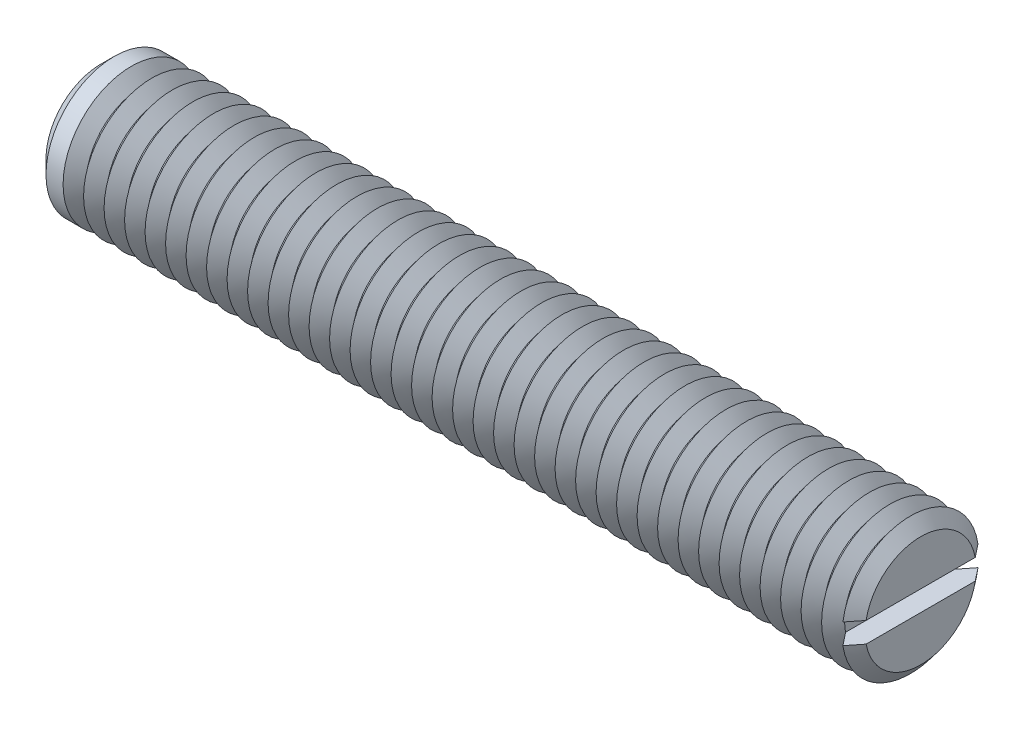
from build123d import *

# Parameters (mm, degrees)
SKETCH1_R       = 5
EXTRUDE1_DEPTH  = 30
SKETCH2_W       = 1.5
SKETCH2_H       = 1.5
EXTRUDE2_DEPTH  = 7.5
CHAMFER1_SIZE   = 1
LPATTERN1_COUNT = 39
LPATTERN1_PITCH = 1.5


with BuildPart() as part:
    # Sketch1 → Extrude1 (new, symmetric)
    with BuildSketch(Plane(origin=(0, 0, 0), x_dir=(0, 0, -1), z_dir=(1, 0, 0))):
        Circle(SKETCH1_R)
    extrude(amount=EXTRUDE1_DEPTH, both=True)

    # Sketch2 → Extrude2 (cut, symmetric)
    with BuildSketch(Plane.XY):
        with Locations((29.25, 0)):
            Rectangle(SKETCH2_W, SKETCH2_H)
    extrude(amount=EXTRUDE2_DEPTH, both=True, mode=Mode.SUBTRACT)

    # Chamfer1
    chamfer1_edges = [part.edges().sort_by_distance(p)[0] for p in [
        (-30, 0, 5),
    ]]
    chamfer(chamfer1_edges, length=CHAMFER1_SIZE)

    # Sketch3 → Cut-Revolve1 (revolve, cut)
    with BuildSketch(Plane.XY, mode=Mode.PRIVATE) as cut_revolve1_sk:
        Polygon((29.25, -5), (30.75, -5), (30, -4.0632503), align=None)
    cut_revolve1 = revolve(cut_revolve1_sk.sketch.rotate(Axis((0, 0, 0), (1, 0, 0)), 261.373073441), axis=Axis((0, 0, 0), (1, 0, 0)), mode=Mode.SUBTRACT)

    # LPattern1: Cut-Revolve1 ×39
    with Locations(*[(-i * LPATTERN1_PITCH, 0, 0) for i in range(1, LPATTERN1_COUNT)]):
        add(cut_revolve1, mode=Mode.SUBTRACT)


solid = part.part
